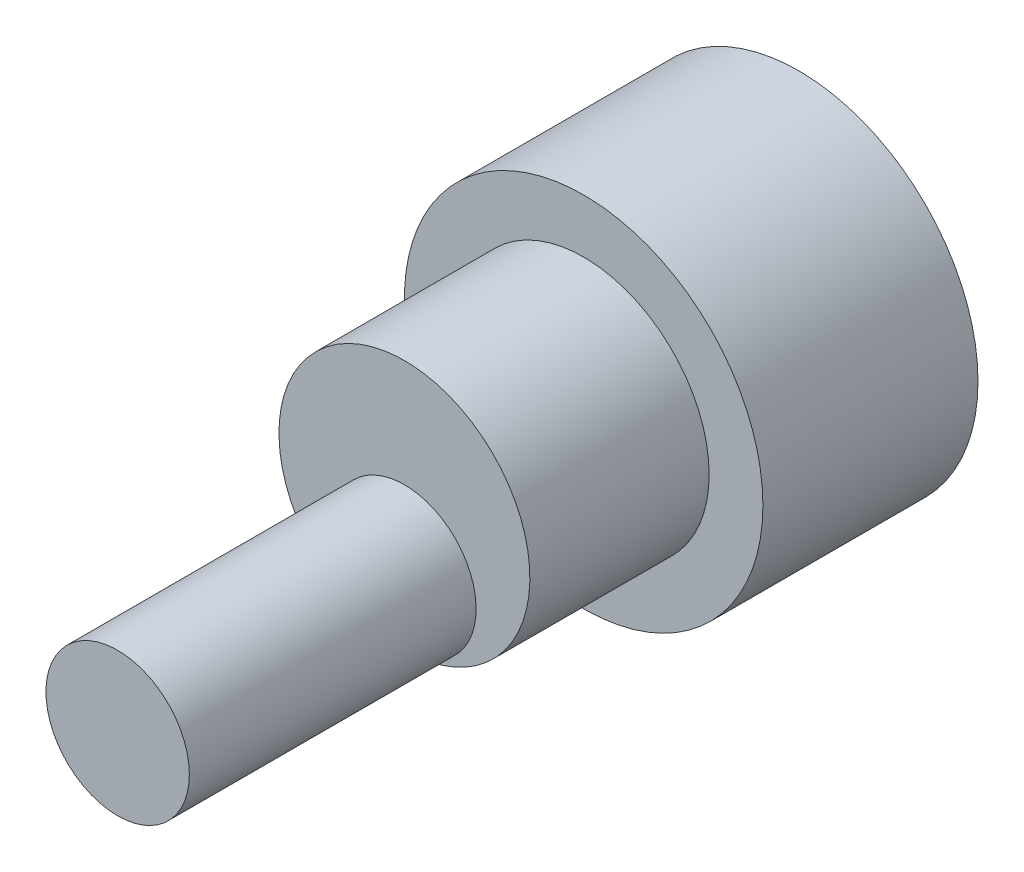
ISO-10303-21;
HEADER;
FILE_DESCRIPTION(('STEP AP214'),'2;1');
FILE_NAME('part.step','',(''),(''),'','','');
FILE_SCHEMA(('AUTOMOTIVE_DESIGN { 1 0 10303 214 1 1 1 1 }'));
ENDSEC;
DATA;
#1=APPLICATION_CONTEXT('core data for automotive mechanical design processes');
#2=APPLICATION_PROTOCOL_DEFINITION('international standard','automotive_design',2000,#1);
#3=PRODUCT_CONTEXT('',#1,'mechanical');
#4=PRODUCT('Part','Part','',(#3));
#5=PRODUCT_RELATED_PRODUCT_CATEGORY('part','',(#4));
#6=PRODUCT_DEFINITION_FORMATION('','',#4);
#7=PRODUCT_DEFINITION_CONTEXT('part definition',#1,'design');
#8=PRODUCT_DEFINITION('design','',#6,#7);
#9=PRODUCT_DEFINITION_SHAPE('','',#8);
#10=(LENGTH_UNIT() NAMED_UNIT(*) SI_UNIT(.MILLI.,.METRE.));
#11=(NAMED_UNIT(*) PLANE_ANGLE_UNIT() SI_UNIT($,.RADIAN.));
#12=(NAMED_UNIT(*) SI_UNIT($,.STERADIAN.) SOLID_ANGLE_UNIT());
#13=UNCERTAINTY_MEASURE_WITH_UNIT(LENGTH_MEASURE(1.E-05),#10,'distance_accuracy_value','');
#14=(GEOMETRIC_REPRESENTATION_CONTEXT(3) GLOBAL_UNCERTAINTY_ASSIGNED_CONTEXT((#13)) GLOBAL_UNIT_ASSIGNED_CONTEXT((#10,
#11,#12)) REPRESENTATION_CONTEXT('',''));
#15=CARTESIAN_POINT('',(0.,0.,0.));
#16=DIRECTION('',(0.,0.,1.));
#17=DIRECTION('',(1.,0.,0.));
#18=AXIS2_PLACEMENT_3D('',#15,#16,#17);
#19=CARTESIAN_POINT('',(0.,0.,60.));
#20=DIRECTION('',(0.,0.,1.));
#21=DIRECTION('',(1.,0.,0.));
#22=AXIS2_PLACEMENT_3D('',#19,#20,#21);
#23=PLANE('',#22);
#24=CARTESIAN_POINT('',(0.,0.,60.));
#25=DIRECTION('',(0.,0.,1.));
#26=DIRECTION('',(1.,0.,0.));
#27=AXIS2_PLACEMENT_3D('',#24,#25,#26);
#28=CIRCLE('',#27,50.);
#29=CARTESIAN_POINT('',(50.,0.,60.));
#30=VERTEX_POINT('',#29);
#31=EDGE_CURVE('E11',#30,#30,#28,.T.);
#32=ORIENTED_EDGE('',*,*,#31,.T.);
#33=EDGE_LOOP('',(#32));
#34=FACE_BOUND('',#33,.T.);
#35=CARTESIAN_POINT('',(0.,0.,60.));
#36=DIRECTION('',(0.,0.,1.));
#37=DIRECTION('',(1.,0.,0.));
#38=AXIS2_PLACEMENT_3D('',#35,#36,#37);
#39=CIRCLE('',#38,35.);
#40=CARTESIAN_POINT('',(35.,0.,60.));
#41=VERTEX_POINT('',#40);
#42=EDGE_CURVE('E47',#41,#41,#39,.T.);
#43=ORIENTED_EDGE('',*,*,#42,.F.);
#44=EDGE_LOOP('',(#43));
#45=FACE_BOUND('',#44,.T.);
#46=ADVANCED_FACE('F31',(#34,#45),#23,.T.);
#47=CARTESIAN_POINT('',(0.,0.,60.));
#48=DIRECTION('',(0.,0.,-1.));
#49=DIRECTION('',(-1.,0.,0.));
#50=AXIS2_PLACEMENT_3D('',#47,#48,#49);
#51=CYLINDRICAL_SURFACE('',#50,50.);
#52=ORIENTED_EDGE('',*,*,#31,.F.);
#53=EDGE_LOOP('',(#52));
#54=FACE_BOUND('',#53,.T.);
#55=CARTESIAN_POINT('',(0.,0.,0.));
#56=DIRECTION('',(0.,0.,1.));
#57=DIRECTION('',(1.,0.,0.));
#58=AXIS2_PLACEMENT_3D('',#55,#56,#57);
#59=CIRCLE('',#58,50.);
#60=CARTESIAN_POINT('',(50.,0.,0.));
#61=VERTEX_POINT('',#60);
#62=EDGE_CURVE('E35',#61,#61,#59,.T.);
#63=ORIENTED_EDGE('',*,*,#62,.T.);
#64=EDGE_LOOP('',(#63));
#65=FACE_BOUND('',#64,.T.);
#66=ADVANCED_FACE('F33',(#54,#65),#51,.T.);
#67=CARTESIAN_POINT('',(0.,0.,0.));
#68=DIRECTION('',(0.,0.,1.));
#69=DIRECTION('',(1.,0.,0.));
#70=AXIS2_PLACEMENT_3D('',#67,#68,#69);
#71=PLANE('',#70);
#72=ORIENTED_EDGE('',*,*,#62,.F.);
#73=EDGE_LOOP('',(#72));
#74=FACE_BOUND('',#73,.T.);
#75=ADVANCED_FACE('F72',(#74),#71,.F.);
#76=CARTESIAN_POINT('',(0.,0.,110.));
#77=DIRECTION('',(0.,0.,-1.));
#78=DIRECTION('',(-1.,0.,0.));
#79=AXIS2_PLACEMENT_3D('',#76,#77,#78);
#80=CYLINDRICAL_SURFACE('',#79,35.);
#81=CARTESIAN_POINT('',(0.,0.,110.));
#82=DIRECTION('',(0.,0.,1.));
#83=DIRECTION('',(1.,0.,0.));
#84=AXIS2_PLACEMENT_3D('',#81,#82,#83);
#85=CIRCLE('',#84,35.);
#86=CARTESIAN_POINT('',(0.,-35.,110.));
#87=VERTEX_POINT('',#86);
#88=EDGE_CURVE('E42',#87,#87,#85,.T.);
#89=ORIENTED_EDGE('',*,*,#88,.F.);
#90=EDGE_LOOP('',(#89));
#91=FACE_BOUND('',#90,.T.);
#92=ORIENTED_EDGE('',*,*,#42,.T.);
#93=EDGE_LOOP('',(#92));
#94=FACE_BOUND('',#93,.T.);
#95=ADVANCED_FACE('F43',(#91,#94),#80,.T.);
#96=CARTESIAN_POINT('',(0.,0.,110.));
#97=DIRECTION('',(0.,0.,1.));
#98=DIRECTION('',(1.,0.,0.));
#99=AXIS2_PLACEMENT_3D('',#96,#97,#98);
#100=PLANE('',#99);
#101=ORIENTED_EDGE('',*,*,#88,.T.);
#102=CARTESIAN_POINT('',(0.,-15.,110.));
#103=DIRECTION('',(0.,0.,1.));
#104=DIRECTION('',(1.,0.,0.));
#105=AXIS2_PLACEMENT_3D('',#102,#103,#104);
#106=CIRCLE('',#105,20.);
#107=EDGE_CURVE('E54',#87,#87,#106,.T.);
#108=ORIENTED_EDGE('',*,*,#107,.F.);
#109=EDGE_LOOP('',(#101,#108));
#110=FACE_BOUND('',#109,.T.);
#111=ADVANCED_FACE('F65',(#110),#100,.T.);
#112=CARTESIAN_POINT('',(0.,-15.,190.));
#113=DIRECTION('',(0.,0.,-1.));
#114=DIRECTION('',(-1.,0.,0.));
#115=AXIS2_PLACEMENT_3D('',#112,#113,#114);
#116=CYLINDRICAL_SURFACE('',#115,20.);
#117=CARTESIAN_POINT('',(0.,-15.,190.));
#118=DIRECTION('',(0.,0.,1.));
#119=DIRECTION('',(1.,0.,0.));
#120=AXIS2_PLACEMENT_3D('',#117,#118,#119);
#121=CIRCLE('',#120,20.);
#122=CARTESIAN_POINT('',(20.,-15.,190.));
#123=VERTEX_POINT('',#122);
#124=EDGE_CURVE('E51',#123,#123,#121,.T.);
#125=ORIENTED_EDGE('',*,*,#124,.F.);
#126=EDGE_LOOP('',(#125));
#127=FACE_BOUND('',#126,.T.);
#128=ORIENTED_EDGE('',*,*,#107,.T.);
#129=EDGE_LOOP('',(#128));
#130=FACE_BOUND('',#129,.T.);
#131=ADVANCED_FACE('F62',(#127,#130),#116,.T.);
#132=CARTESIAN_POINT('',(0.,-15.,190.));
#133=DIRECTION('',(0.,0.,1.));
#134=DIRECTION('',(1.,0.,0.));
#135=AXIS2_PLACEMENT_3D('',#132,#133,#134);
#136=PLANE('',#135);
#137=ORIENTED_EDGE('',*,*,#124,.T.);
#138=EDGE_LOOP('',(#137));
#139=FACE_BOUND('',#138,.T.);
#140=ADVANCED_FACE('F60',(#139),#136,.T.);
#141=CLOSED_SHELL('',(#46,#66,#75,#95,#111,#131,#140));
#142=MANIFOLD_SOLID_BREP('B2',#141);
#143=ADVANCED_BREP_SHAPE_REPRESENTATION('',(#18,#142),#14);
#144=SHAPE_DEFINITION_REPRESENTATION(#9,#143);
ENDSEC;
END-ISO-10303-21;
